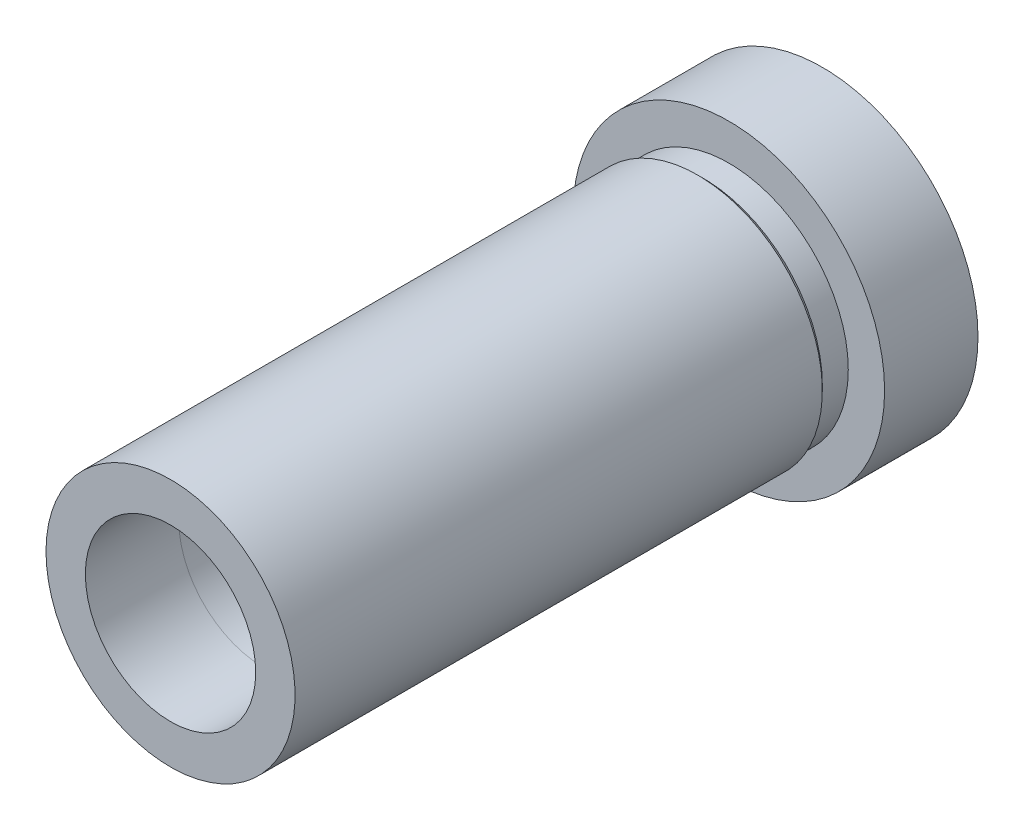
ISO-10303-21;
HEADER;
FILE_DESCRIPTION(('STEP AP214'),'2;1');
FILE_NAME('part.step','',(''),(''),'','','');
FILE_SCHEMA(('AUTOMOTIVE_DESIGN { 1 0 10303 214 1 1 1 1 }'));
ENDSEC;
DATA;
#1=APPLICATION_CONTEXT('core data for automotive mechanical design processes');
#2=APPLICATION_PROTOCOL_DEFINITION('international standard','automotive_design',2000,#1);
#3=PRODUCT_CONTEXT('',#1,'mechanical');
#4=PRODUCT('Part','Part','',(#3));
#5=PRODUCT_RELATED_PRODUCT_CATEGORY('part','',(#4));
#6=PRODUCT_DEFINITION_FORMATION('','',#4);
#7=PRODUCT_DEFINITION_CONTEXT('part definition',#1,'design');
#8=PRODUCT_DEFINITION('design','',#6,#7);
#9=PRODUCT_DEFINITION_SHAPE('','',#8);
#10=(LENGTH_UNIT() NAMED_UNIT(*) SI_UNIT(.MILLI.,.METRE.));
#11=(NAMED_UNIT(*) PLANE_ANGLE_UNIT() SI_UNIT($,.RADIAN.));
#12=(NAMED_UNIT(*) SI_UNIT($,.STERADIAN.) SOLID_ANGLE_UNIT());
#13=UNCERTAINTY_MEASURE_WITH_UNIT(LENGTH_MEASURE(1.E-05),#10,'distance_accuracy_value','');
#14=(GEOMETRIC_REPRESENTATION_CONTEXT(3) GLOBAL_UNCERTAINTY_ASSIGNED_CONTEXT((#13)) GLOBAL_UNIT_ASSIGNED_CONTEXT((#10,
#11,#12)) REPRESENTATION_CONTEXT('',''));
#15=CARTESIAN_POINT('',(0.,0.,0.));
#16=DIRECTION('',(0.,0.,1.));
#17=DIRECTION('',(1.,0.,0.));
#18=AXIS2_PLACEMENT_3D('',#15,#16,#17);
#19=CARTESIAN_POINT('',(-7.93750000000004,0.,-4.7625));
#20=DIRECTION('',(0.,0.,1.));
#21=DIRECTION('',(1.,0.,0.));
#22=AXIS2_PLACEMENT_3D('',#19,#20,#21);
#23=PLANE('',#22);
#24=CARTESIAN_POINT('',(0.,0.,-4.7625));
#25=DIRECTION('',(0.,0.,-1.));
#26=DIRECTION('',(-1.,0.,0.));
#27=AXIS2_PLACEMENT_3D('',#24,#25,#26);
#28=CIRCLE('',#27,4.50341237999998);
#29=CARTESIAN_POINT('',(-4.50341237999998,0.,-4.7625));
#30=VERTEX_POINT('',#29);
#31=EDGE_CURVE('E82',#30,#30,#28,.T.);
#32=ORIENTED_EDGE('',*,*,#31,.F.);
#33=EDGE_LOOP('',(#32));
#34=FACE_BOUND('',#33,.T.);
#35=CARTESIAN_POINT('',(0.,0.,-4.7625));
#36=DIRECTION('',(0.,0.,-1.));
#37=DIRECTION('',(-1.,0.,0.));
#38=AXIS2_PLACEMENT_3D('',#35,#36,#37);
#39=CIRCLE('',#38,7.9375);
#40=CARTESIAN_POINT('',(-7.9375,0.,-4.7625));
#41=VERTEX_POINT('',#40);
#42=EDGE_CURVE('E10',#41,#41,#39,.T.);
#43=ORIENTED_EDGE('',*,*,#42,.T.);
#44=EDGE_LOOP('',(#43));
#45=FACE_BOUND('',#44,.T.);
#46=ADVANCED_FACE('F41',(#34,#45),#23,.F.);
#47=CARTESIAN_POINT('',(0.,0.,-19.4322936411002));
#48=DIRECTION('',(0.,0.,-1.));
#49=DIRECTION('',(-1.,0.,0.));
#50=AXIS2_PLACEMENT_3D('',#47,#48,#49);
#51=CYLINDRICAL_SURFACE('',#50,7.9375);
#52=ORIENTED_EDGE('',*,*,#42,.F.);
#53=EDGE_LOOP('',(#52));
#54=FACE_BOUND('',#53,.T.);
#55=CARTESIAN_POINT('',(0.,0.,0.));
#56=DIRECTION('',(0.,0.,-1.));
#57=DIRECTION('',(-1.,0.,0.));
#58=AXIS2_PLACEMENT_3D('',#55,#56,#57);
#59=CIRCLE('',#58,7.9375);
#60=CARTESIAN_POINT('',(-7.9375,0.,0.));
#61=VERTEX_POINT('',#60);
#62=EDGE_CURVE('E48',#61,#61,#59,.T.);
#63=ORIENTED_EDGE('',*,*,#62,.T.);
#64=EDGE_LOOP('',(#63));
#65=FACE_BOUND('',#64,.T.);
#66=ADVANCED_FACE('F91',(#54,#65),#51,.T.);
#67=CARTESIAN_POINT('',(-6.08541666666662,0.,0.));
#68=DIRECTION('',(0.,0.,-1.));
#69=DIRECTION('',(-1.,0.,0.));
#70=AXIS2_PLACEMENT_3D('',#67,#68,#69);
#71=PLANE('',#70);
#72=ORIENTED_EDGE('',*,*,#62,.F.);
#73=EDGE_LOOP('',(#72));
#74=FACE_BOUND('',#73,.T.);
#75=CARTESIAN_POINT('',(0.,0.,0.));
#76=DIRECTION('',(0.,0.,-1.));
#77=DIRECTION('',(-1.,0.,0.));
#78=AXIS2_PLACEMENT_3D('',#75,#76,#77);
#79=CIRCLE('',#78,6.08541666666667);
#80=CARTESIAN_POINT('',(-6.08541666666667,0.,0.));
#81=VERTEX_POINT('',#80);
#82=EDGE_CURVE('E54',#81,#81,#79,.T.);
#83=ORIENTED_EDGE('',*,*,#82,.T.);
#84=EDGE_LOOP('',(#83));
#85=FACE_BOUND('',#84,.T.);
#86=ADVANCED_FACE('F95',(#74,#85),#71,.F.);
#87=CARTESIAN_POINT('',(0.,0.,-19.4322936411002));
#88=DIRECTION('',(0.,0.,-1.));
#89=DIRECTION('',(-1.,0.,0.));
#90=AXIS2_PLACEMENT_3D('',#87,#88,#89);
#91=CYLINDRICAL_SURFACE('',#90,6.08541666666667);
#92=ORIENTED_EDGE('',*,*,#82,.F.);
#93=EDGE_LOOP('',(#92));
#94=FACE_BOUND('',#93,.T.);
#95=CARTESIAN_POINT('',(0.,0.,1.32291666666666));
#96=DIRECTION('',(0.,0.,-1.));
#97=DIRECTION('',(-1.,0.,0.));
#98=AXIS2_PLACEMENT_3D('',#95,#96,#97);
#99=CIRCLE('',#98,6.08541666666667);
#100=CARTESIAN_POINT('',(-6.08541666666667,0.,1.32291666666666));
#101=VERTEX_POINT('',#100);
#102=EDGE_CURVE('E60',#101,#101,#99,.T.);
#103=ORIENTED_EDGE('',*,*,#102,.T.);
#104=EDGE_LOOP('',(#103));
#105=FACE_BOUND('',#104,.T.);
#106=ADVANCED_FACE('F100',(#94,#105),#91,.T.);
#107=CARTESIAN_POINT('',(0.,0.,1.5875));
#108=DIRECTION('',(0.,0.,1.));
#109=DIRECTION('',(1.,0.,0.));
#110=AXIS2_PLACEMENT_3D('',#107,#108,#109);
#111=CONICAL_SURFACE('',#110,6.35000000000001,0.785398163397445);
#112=ORIENTED_EDGE('',*,*,#102,.F.);
#113=EDGE_LOOP('',(#112));
#114=FACE_BOUND('',#113,.T.);
#115=CARTESIAN_POINT('',(0.,0.,1.5875));
#116=DIRECTION('',(0.,0.,-1.));
#117=DIRECTION('',(-1.,0.,0.));
#118=AXIS2_PLACEMENT_3D('',#115,#116,#117);
#119=CIRCLE('',#118,6.35000000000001);
#120=CARTESIAN_POINT('',(-6.35000000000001,0.,1.5875));
#121=VERTEX_POINT('',#120);
#122=EDGE_CURVE('E66',#121,#121,#119,.T.);
#123=ORIENTED_EDGE('',*,*,#122,.T.);
#124=EDGE_LOOP('',(#123));
#125=FACE_BOUND('',#124,.T.);
#126=ADVANCED_FACE('F106',(#114,#125),#111,.T.);
#127=CARTESIAN_POINT('',(0.,0.,-19.4322936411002));
#128=DIRECTION('',(0.,0.,-1.));
#129=DIRECTION('',(-1.,0.,0.));
#130=AXIS2_PLACEMENT_3D('',#127,#128,#129);
#131=CYLINDRICAL_SURFACE('',#130,6.35000000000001);
#132=ORIENTED_EDGE('',*,*,#122,.F.);
#133=EDGE_LOOP('',(#132));
#134=FACE_BOUND('',#133,.T.);
#135=CARTESIAN_POINT('',(0.,0.,28.4734));
#136=DIRECTION('',(0.,0.,-1.));
#137=DIRECTION('',(-1.,0.,0.));
#138=AXIS2_PLACEMENT_3D('',#135,#136,#137);
#139=CIRCLE('',#138,6.35000000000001);
#140=CARTESIAN_POINT('',(-6.35000000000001,0.,28.4734));
#141=VERTEX_POINT('',#140);
#142=EDGE_CURVE('E70',#141,#141,#139,.T.);
#143=ORIENTED_EDGE('',*,*,#142,.T.);
#144=EDGE_LOOP('',(#143));
#145=FACE_BOUND('',#144,.T.);
#146=ADVANCED_FACE('F110',(#134,#145),#131,.T.);
#147=CARTESIAN_POINT('',(-4.3434,0.,28.4734));
#148=DIRECTION('',(0.,0.,-1.));
#149=DIRECTION('',(-1.,0.,0.));
#150=AXIS2_PLACEMENT_3D('',#147,#148,#149);
#151=PLANE('',#150);
#152=ORIENTED_EDGE('',*,*,#142,.F.);
#153=EDGE_LOOP('',(#152));
#154=FACE_BOUND('',#153,.T.);
#155=CARTESIAN_POINT('',(0.,0.,28.4734));
#156=DIRECTION('',(0.,0.,-1.));
#157=DIRECTION('',(-1.,0.,0.));
#158=AXIS2_PLACEMENT_3D('',#155,#156,#157);
#159=CIRCLE('',#158,4.34339999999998);
#160=CARTESIAN_POINT('',(-4.34339999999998,0.,28.4734));
#161=VERTEX_POINT('',#160);
#162=EDGE_CURVE('E74',#161,#161,#159,.T.);
#163=ORIENTED_EDGE('',*,*,#162,.T.);
#164=EDGE_LOOP('',(#163));
#165=FACE_BOUND('',#164,.T.);
#166=ADVANCED_FACE('F114',(#154,#165),#151,.F.);
#167=CARTESIAN_POINT('',(0.,0.,-19.4322936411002));
#168=DIRECTION('',(0.,0.,-1.));
#169=DIRECTION('',(-1.,0.,0.));
#170=AXIS2_PLACEMENT_3D('',#167,#168,#169);
#171=CYLINDRICAL_SURFACE('',#170,4.34339999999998);
#172=ORIENTED_EDGE('',*,*,#162,.F.);
#173=EDGE_LOOP('',(#172));
#174=FACE_BOUND('',#173,.T.);
#175=CARTESIAN_POINT('',(0.,0.,23.7109));
#176=DIRECTION('',(0.,0.,-1.));
#177=DIRECTION('',(-1.,0.,0.));
#178=AXIS2_PLACEMENT_3D('',#175,#176,#177);
#179=CIRCLE('',#178,4.34339999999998);
#180=CARTESIAN_POINT('',(-4.34339999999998,0.,23.7109));
#181=VERTEX_POINT('',#180);
#182=EDGE_CURVE('E78',#181,#181,#179,.T.);
#183=ORIENTED_EDGE('',*,*,#182,.T.);
#184=EDGE_LOOP('',(#183));
#185=FACE_BOUND('',#184,.T.);
#186=ADVANCED_FACE('F118',(#174,#185),#171,.F.);
#187=CARTESIAN_POINT('',(0.,0.,-4.7625));
#188=DIRECTION('',(0.,0.,-1.));
#189=DIRECTION('',(-1.,0.,0.));
#190=AXIS2_PLACEMENT_3D('',#187,#188,#189);
#191=CONICAL_SURFACE('',#190,4.50341237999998,0.00561965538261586);
#192=ORIENTED_EDGE('',*,*,#182,.F.);
#193=EDGE_LOOP('',(#192));
#194=FACE_BOUND('',#193,.T.);
#195=ORIENTED_EDGE('',*,*,#31,.T.);
#196=EDGE_LOOP('',(#195));
#197=FACE_BOUND('',#196,.T.);
#198=ADVANCED_FACE('F88',(#194,#197),#191,.F.);
#199=CLOSED_SHELL('',(#46,#66,#86,#106,#126,#146,#166,#186,#198));
#200=MANIFOLD_SOLID_BREP('B2',#199);
#201=ADVANCED_BREP_SHAPE_REPRESENTATION('',(#18,#200),#14);
#202=SHAPE_DEFINITION_REPRESENTATION(#9,#201);
ENDSEC;
END-ISO-10303-21;
